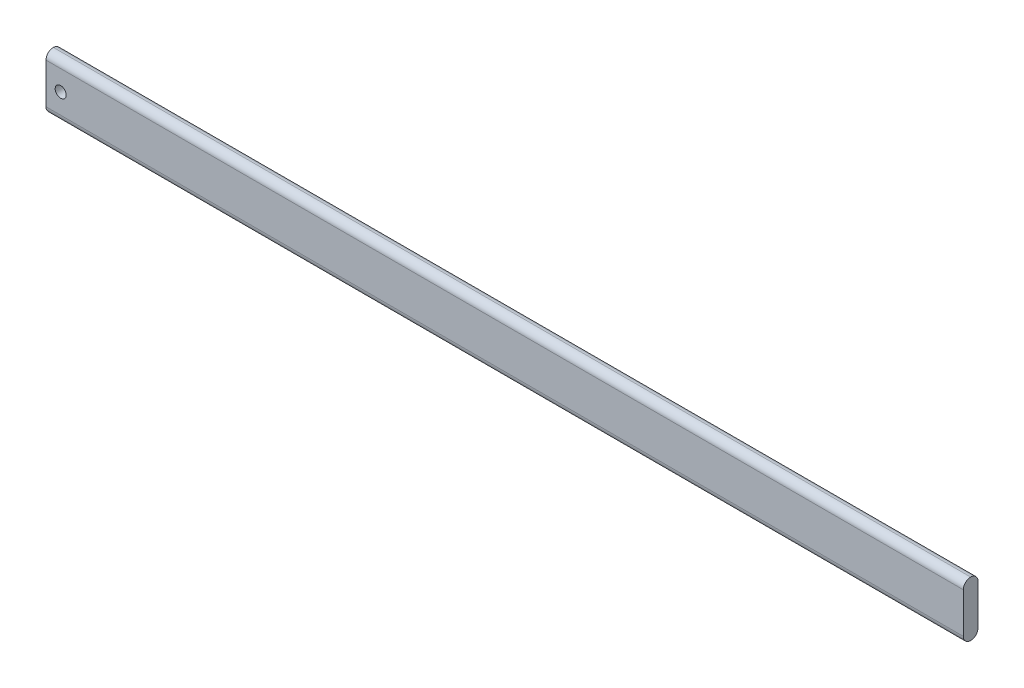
ISO-10303-21;
HEADER;
FILE_DESCRIPTION(('STEP AP214'),'2;1');
FILE_NAME('part.step','',(''),(''),'','','');
FILE_SCHEMA(('AUTOMOTIVE_DESIGN { 1 0 10303 214 1 1 1 1 }'));
ENDSEC;
DATA;
#1=APPLICATION_CONTEXT('core data for automotive mechanical design processes');
#2=APPLICATION_PROTOCOL_DEFINITION('international standard','automotive_design',2000,#1);
#3=PRODUCT_CONTEXT('',#1,'mechanical');
#4=PRODUCT('Part','Part','',(#3));
#5=PRODUCT_RELATED_PRODUCT_CATEGORY('part','',(#4));
#6=PRODUCT_DEFINITION_FORMATION('','',#4);
#7=PRODUCT_DEFINITION_CONTEXT('part definition',#1,'design');
#8=PRODUCT_DEFINITION('design','',#6,#7);
#9=PRODUCT_DEFINITION_SHAPE('','',#8);
#10=(LENGTH_UNIT() NAMED_UNIT(*) SI_UNIT(.MILLI.,.METRE.));
#11=(NAMED_UNIT(*) PLANE_ANGLE_UNIT() SI_UNIT($,.RADIAN.));
#12=(NAMED_UNIT(*) SI_UNIT($,.STERADIAN.) SOLID_ANGLE_UNIT());
#13=UNCERTAINTY_MEASURE_WITH_UNIT(LENGTH_MEASURE(1.E-05),#10,'distance_accuracy_value','');
#14=(GEOMETRIC_REPRESENTATION_CONTEXT(3) GLOBAL_UNCERTAINTY_ASSIGNED_CONTEXT((#13)) GLOBAL_UNIT_ASSIGNED_CONTEXT((#10,
#11,#12)) REPRESENTATION_CONTEXT('',''));
#15=CARTESIAN_POINT('',(0.,0.,0.));
#16=DIRECTION('',(0.,0.,1.));
#17=DIRECTION('',(1.,0.,0.));
#18=AXIS2_PLACEMENT_3D('',#15,#16,#17);
#19=CARTESIAN_POINT('',(-110.,20.,8.00000000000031));
#20=DIRECTION('',(0.,0.,1.));
#21=DIRECTION('',(1.,0.,0.));
#22=AXIS2_PLACEMENT_3D('',#19,#20,#21);
#23=PLANE('',#22);
#24=DIRECTION('',(0.,-1.,0.));
#25=VECTOR('',#24,1.);
#26=CARTESIAN_POINT('',(-110.,20.,8.00000000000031));
#27=LINE('',#26,#25);
#28=CARTESIAN_POINT('',(-110.,16.,8.00000000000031));
#29=VERTEX_POINT('',#28);
#30=CARTESIAN_POINT('',(-110.,-6.00000000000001,8.00000000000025));
#31=VERTEX_POINT('',#30);
#32=EDGE_CURVE('E119',#29,#31,#27,.T.);
#33=ORIENTED_EDGE('',*,*,#32,.T.);
#34=DIRECTION('',(-1.,0.,0.));
#35=VECTOR('',#34,1.);
#36=CARTESIAN_POINT('',(-110.,-6.00000000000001,8.00000000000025));
#37=LINE('',#36,#35);
#38=CARTESIAN_POINT('',(390.,-5.99999999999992,7.99999999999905));
#39=VERTEX_POINT('',#38);
#40=EDGE_CURVE('E11',#31,#39,#37,.F.);
#41=ORIENTED_EDGE('',*,*,#40,.T.);
#42=DIRECTION('',(0.,1.,0.));
#43=VECTOR('',#42,1.);
#44=CARTESIAN_POINT('',(390.,-9.99999999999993,7.99999999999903));
#45=LINE('',#44,#43);
#46=CARTESIAN_POINT('',(390.,16.,7.99999999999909));
#47=VERTEX_POINT('',#46);
#48=EDGE_CURVE('E115',#39,#47,#45,.T.);
#49=ORIENTED_EDGE('',*,*,#48,.T.);
#50=DIRECTION('',(1.,0.,0.));
#51=VECTOR('',#50,1.);
#52=CARTESIAN_POINT('',(-110.,16.,8.00000000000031));
#53=LINE('',#52,#51);
#54=EDGE_CURVE('E45',#47,#29,#53,.F.);
#55=ORIENTED_EDGE('',*,*,#54,.T.);
#56=EDGE_LOOP('',(#33,#41,#49,#55));
#57=FACE_BOUND('',#56,.T.);
#58=CARTESIAN_POINT('',(-102.,5.00000000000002,8.00000000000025));
#59=DIRECTION('',(0.,0.,1.));
#60=DIRECTION('',(1.,0.,0.));
#61=AXIS2_PLACEMENT_3D('',#58,#59,#60);
#62=CIRCLE('',#61,3.00000000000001);
#63=CARTESIAN_POINT('',(-99.,5.00000000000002,8.00000000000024));
#64=VERTEX_POINT('',#63);
#65=EDGE_CURVE('E111',#64,#64,#62,.T.);
#66=ORIENTED_EDGE('',*,*,#65,.F.);
#67=EDGE_LOOP('',(#66));
#68=FACE_BOUND('',#67,.T.);
#69=ADVANCED_FACE('F35',(#57,#68),#23,.T.);
#70=CARTESIAN_POINT('',(-110.,20.,3.20056481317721E-13));
#71=DIRECTION('',(0.,0.,1.));
#72=DIRECTION('',(1.,0.,0.));
#73=AXIS2_PLACEMENT_3D('',#70,#71,#72);
#74=PLANE('',#73);
#75=DIRECTION('',(0.,1.,0.));
#76=VECTOR('',#75,1.);
#77=CARTESIAN_POINT('',(390.,-9.99999999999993,-9.67975699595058E-13));
#78=LINE('',#77,#76);
#79=CARTESIAN_POINT('',(390.,-5.99999999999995,-9.60169443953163E-13));
#80=VERTEX_POINT('',#79);
#81=CARTESIAN_POINT('',(390.,16.,-9.05525654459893E-13));
#82=VERTEX_POINT('',#81);
#83=EDGE_CURVE('E110',#80,#82,#78,.T.);
#84=ORIENTED_EDGE('',*,*,#83,.F.);
#85=DIRECTION('',(-1.,0.,0.));
#86=VECTOR('',#85,1.);
#87=CARTESIAN_POINT('',(-110.,-6.00000000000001,2.4980018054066E-13));
#88=LINE('',#87,#86);
#89=CARTESIAN_POINT('',(-110.,-6.00000000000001,2.4980018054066E-13));
#90=VERTEX_POINT('',#89);
#91=EDGE_CURVE('E100',#80,#90,#88,.T.);
#92=ORIENTED_EDGE('',*,*,#91,.T.);
#93=DIRECTION('',(0.,-1.,0.));
#94=VECTOR('',#93,1.);
#95=CARTESIAN_POINT('',(-110.,20.,3.20056481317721E-13));
#96=LINE('',#95,#94);
#97=CARTESIAN_POINT('',(-110.,16.,3.0444397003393E-13));
#98=VERTEX_POINT('',#97);
#99=EDGE_CURVE('E93',#98,#90,#96,.T.);
#100=ORIENTED_EDGE('',*,*,#99,.F.);
#101=DIRECTION('',(1.,0.,0.));
#102=VECTOR('',#101,1.);
#103=CARTESIAN_POINT('',(390.,16.,-9.05525654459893E-13));
#104=LINE('',#103,#102);
#105=EDGE_CURVE('E107',#98,#82,#104,.T.);
#106=ORIENTED_EDGE('',*,*,#105,.T.);
#107=EDGE_LOOP('',(#84,#92,#100,#106));
#108=FACE_BOUND('',#107,.T.);
#109=CARTESIAN_POINT('',(-102.,5.00000000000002,2.65412691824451E-13));
#110=DIRECTION('',(0.,0.,1.));
#111=DIRECTION('',(1.,0.,0.));
#112=AXIS2_PLACEMENT_3D('',#109,#110,#111);
#113=CIRCLE('',#112,3.00000000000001);
#114=CARTESIAN_POINT('',(-99.,5.00000000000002,2.58167433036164E-13));
#115=VERTEX_POINT('',#114);
#116=EDGE_CURVE('E137',#115,#115,#113,.T.);
#117=ORIENTED_EDGE('',*,*,#116,.T.);
#118=EDGE_LOOP('',(#117));
#119=FACE_BOUND('',#118,.T.);
#120=ADVANCED_FACE('F105',(#108,#119),#74,.F.);
#121=CARTESIAN_POINT('',(-110.,20.,8.00000000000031));
#122=DIRECTION('',(1.,0.,0.));
#123=DIRECTION('',(0.,0.,-1.));
#124=AXIS2_PLACEMENT_3D('',#121,#122,#123);
#125=PLANE('',#124);
#126=ORIENTED_EDGE('',*,*,#99,.T.);
#127=CARTESIAN_POINT('',(-110.,-6.00000000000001,4.00000000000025));
#128=DIRECTION('',(1.,0.,0.));
#129=DIRECTION('',(0.,0.,-1.));
#130=AXIS2_PLACEMENT_3D('',#127,#128,#129);
#131=CIRCLE('',#130,4.);
#132=CARTESIAN_POINT('',(-110.,-10.,4.00000000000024));
#133=VERTEX_POINT('',#132);
#134=EDGE_CURVE('E126',#90,#133,#131,.F.);
#135=ORIENTED_EDGE('',*,*,#134,.T.);
#136=CARTESIAN_POINT('',(-110.,-6.00000000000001,4.00000000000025));
#137=DIRECTION('',(1.,0.,0.));
#138=DIRECTION('',(0.,0.,-1.));
#139=AXIS2_PLACEMENT_3D('',#136,#137,#138);
#140=CIRCLE('',#139,4.);
#141=EDGE_CURVE('E124',#133,#31,#140,.F.);
#142=ORIENTED_EDGE('',*,*,#141,.T.);
#143=ORIENTED_EDGE('',*,*,#32,.F.);
#144=CARTESIAN_POINT('',(-110.,16.,4.0000000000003));
#145=DIRECTION('',(1.,0.,0.));
#146=DIRECTION('',(0.,0.,-1.));
#147=AXIS2_PLACEMENT_3D('',#144,#145,#146);
#148=CIRCLE('',#147,4.);
#149=CARTESIAN_POINT('',(-110.,20.,4.00000000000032));
#150=VERTEX_POINT('',#149);
#151=EDGE_CURVE('E95',#29,#150,#148,.F.);
#152=ORIENTED_EDGE('',*,*,#151,.T.);
#153=CARTESIAN_POINT('',(-110.,16.,4.0000000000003));
#154=DIRECTION('',(1.,0.,0.));
#155=DIRECTION('',(0.,0.,-1.));
#156=AXIS2_PLACEMENT_3D('',#153,#154,#155);
#157=CIRCLE('',#156,4.);
#158=EDGE_CURVE('E90',#150,#98,#157,.F.);
#159=ORIENTED_EDGE('',*,*,#158,.T.);
#160=EDGE_LOOP('',(#126,#135,#142,#143,#152,#159));
#161=FACE_BOUND('',#160,.T.);
#162=ADVANCED_FACE('F92',(#161),#125,.F.);
#163=CARTESIAN_POINT('',(390.,-9.99999999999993,7.99999999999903));
#164=DIRECTION('',(-1.,0.,0.));
#165=DIRECTION('',(0.,0.,1.));
#166=AXIS2_PLACEMENT_3D('',#163,#164,#165);
#167=PLANE('',#166);
#168=CARTESIAN_POINT('',(390.,-5.99999999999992,3.99999999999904));
#169=DIRECTION('',(-1.,0.,0.));
#170=DIRECTION('',(0.,0.,1.));
#171=AXIS2_PLACEMENT_3D('',#168,#169,#170);
#172=CIRCLE('',#171,4.);
#173=CARTESIAN_POINT('',(390.,-9.99999999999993,3.99999999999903));
#174=VERTEX_POINT('',#173);
#175=EDGE_CURVE('E53',#39,#174,#172,.F.);
#176=ORIENTED_EDGE('',*,*,#175,.T.);
#177=CARTESIAN_POINT('',(390.,-5.99999999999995,3.99999999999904));
#178=DIRECTION('',(-1.,0.,0.));
#179=DIRECTION('',(0.,0.,1.));
#180=AXIS2_PLACEMENT_3D('',#177,#178,#179);
#181=CIRCLE('',#180,4.);
#182=EDGE_CURVE('E131',#174,#80,#181,.F.);
#183=ORIENTED_EDGE('',*,*,#182,.T.);
#184=ORIENTED_EDGE('',*,*,#83,.T.);
#185=CARTESIAN_POINT('',(390.,16.,3.99999999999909));
#186=DIRECTION('',(-1.,0.,0.));
#187=DIRECTION('',(0.,0.,1.));
#188=AXIS2_PLACEMENT_3D('',#185,#186,#187);
#189=CIRCLE('',#188,4.);
#190=CARTESIAN_POINT('',(390.,20.,3.99999999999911));
#191=VERTEX_POINT('',#190);
#192=EDGE_CURVE('E114',#82,#191,#189,.F.);
#193=ORIENTED_EDGE('',*,*,#192,.T.);
#194=CARTESIAN_POINT('',(390.,16.,3.99999999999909));
#195=DIRECTION('',(-1.,0.,0.));
#196=DIRECTION('',(0.,0.,1.));
#197=AXIS2_PLACEMENT_3D('',#194,#195,#196);
#198=CIRCLE('',#197,4.);
#199=EDGE_CURVE('E59',#191,#47,#198,.F.);
#200=ORIENTED_EDGE('',*,*,#199,.T.);
#201=ORIENTED_EDGE('',*,*,#48,.F.);
#202=EDGE_LOOP('',(#176,#183,#184,#193,#200,#201));
#203=FACE_BOUND('',#202,.T.);
#204=ADVANCED_FACE('F167',(#203),#167,.F.);
#205=CARTESIAN_POINT('',(-102.,5.00000000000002,8.00000000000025));
#206=DIRECTION('',(0.,0.,-1.));
#207=DIRECTION('',(-1.,0.,0.));
#208=AXIS2_PLACEMENT_3D('',#205,#206,#207);
#209=CYLINDRICAL_SURFACE('',#208,3.00000000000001);
#210=ORIENTED_EDGE('',*,*,#65,.T.);
#211=EDGE_LOOP('',(#210));
#212=FACE_BOUND('',#211,.T.);
#213=ORIENTED_EDGE('',*,*,#116,.F.);
#214=EDGE_LOOP('',(#213));
#215=FACE_BOUND('',#214,.T.);
#216=ADVANCED_FACE('F157',(#212,#215),#209,.F.);
#217=CARTESIAN_POINT('',(390.,-5.99999999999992,3.99999999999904));
#218=DIRECTION('',(-1.,0.,0.));
#219=DIRECTION('',(0.,-1.,0.));
#220=AXIS2_PLACEMENT_3D('',#217,#218,#219);
#221=CYLINDRICAL_SURFACE('',#220,4.);
#222=DIRECTION('',(-1.,0.,0.));
#223=VECTOR('',#222,1.);
#224=CARTESIAN_POINT('',(390.,-9.99999999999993,3.99999999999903));
#225=LINE('',#224,#223);
#226=EDGE_CURVE('E134',#174,#133,#225,.T.);
#227=ORIENTED_EDGE('',*,*,#226,.F.);
#228=ORIENTED_EDGE('',*,*,#175,.F.);
#229=ORIENTED_EDGE('',*,*,#40,.F.);
#230=ORIENTED_EDGE('',*,*,#141,.F.);
#231=EDGE_LOOP('',(#227,#228,#229,#230));
#232=FACE_BOUND('',#231,.T.);
#233=ADVANCED_FACE('F175',(#232),#221,.T.);
#234=CARTESIAN_POINT('',(-110.,-6.00000000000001,4.00000000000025));
#235=DIRECTION('',(1.,0.,0.));
#236=DIRECTION('',(0.,1.,0.));
#237=AXIS2_PLACEMENT_3D('',#234,#235,#236);
#238=CYLINDRICAL_SURFACE('',#237,4.);
#239=ORIENTED_EDGE('',*,*,#182,.F.);
#240=ORIENTED_EDGE('',*,*,#226,.T.);
#241=ORIENTED_EDGE('',*,*,#134,.F.);
#242=ORIENTED_EDGE('',*,*,#91,.F.);
#243=EDGE_LOOP('',(#239,#240,#241,#242));
#244=FACE_BOUND('',#243,.T.);
#245=ADVANCED_FACE('F172',(#244),#238,.T.);
#246=CARTESIAN_POINT('',(-110.,16.,4.0000000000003));
#247=DIRECTION('',(-1.,0.,0.));
#248=DIRECTION('',(0.,-1.,0.));
#249=AXIS2_PLACEMENT_3D('',#246,#247,#248);
#250=CYLINDRICAL_SURFACE('',#249,4.);
#251=ORIENTED_EDGE('',*,*,#105,.F.);
#252=ORIENTED_EDGE('',*,*,#158,.F.);
#253=DIRECTION('',(1.,0.,0.));
#254=VECTOR('',#253,1.);
#255=CARTESIAN_POINT('',(-110.,20.,4.00000000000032));
#256=LINE('',#255,#254);
#257=EDGE_CURVE('E39',#191,#150,#256,.F.);
#258=ORIENTED_EDGE('',*,*,#257,.F.);
#259=ORIENTED_EDGE('',*,*,#192,.F.);
#260=EDGE_LOOP('',(#251,#252,#258,#259));
#261=FACE_BOUND('',#260,.T.);
#262=ADVANCED_FACE('F37',(#261),#250,.T.);
#263=CARTESIAN_POINT('',(-110.,16.,4.0000000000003));
#264=DIRECTION('',(1.,0.,0.));
#265=DIRECTION('',(0.,1.,0.));
#266=AXIS2_PLACEMENT_3D('',#263,#264,#265);
#267=CYLINDRICAL_SURFACE('',#266,4.);
#268=ORIENTED_EDGE('',*,*,#151,.F.);
#269=ORIENTED_EDGE('',*,*,#54,.F.);
#270=ORIENTED_EDGE('',*,*,#199,.F.);
#271=ORIENTED_EDGE('',*,*,#257,.T.);
#272=EDGE_LOOP('',(#268,#269,#270,#271));
#273=FACE_BOUND('',#272,.T.);
#274=ADVANCED_FACE('F145',(#273),#267,.T.);
#275=CLOSED_SHELL('',(#69,#120,#162,#204,#216,#233,#245,#262,#274));
#276=MANIFOLD_SOLID_BREP('B2',#275);
#277=ADVANCED_BREP_SHAPE_REPRESENTATION('',(#18,#276),#14);
#278=SHAPE_DEFINITION_REPRESENTATION(#9,#277);
ENDSEC;
END-ISO-10303-21;
